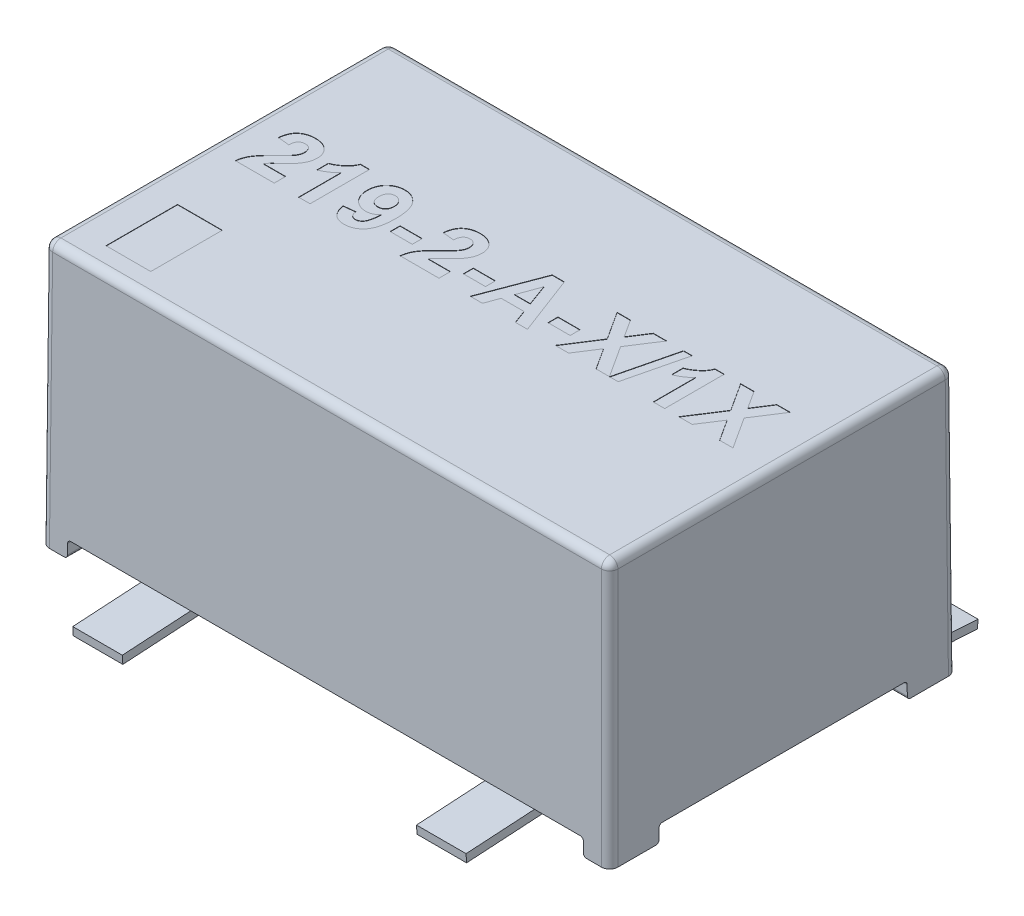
from build123d import *

# Parameters (mm, degrees)
SKETCH1_W                         = 17.2
SKETCH1_H                         = 10.5
MAIN_BODY_DEPTH                   = 7.51
STAND_OFF_FOOT_DEPTH              = 0.5
STAND_OFF_MIRROR2_COPY_1_DEPTH    = 0.5
F_0_36DEG_DRAFT_ANGLE             = -0.36
F_0_25MM_FILLET1_R                = 0.25
F_0_36_INNER_WALL_DRAFT_ANGLE     = 0.36
F_0_36_STAND_OFF_FOOT_DRAFT_ANGLE = 0.36
F_0_20MM_FILLET1_R                = 0.1
SKETCH8_W                         = 1.5
SKETCH8_H                         = 0.25
LPATTERN1_COUNT                   = 2
LPATTERN1_PITCH                   = 4.7
MIRROR2_COPY_1_SKETCH_W           = 1.5
MIRROR2_COPY_1_SKETCH_H           = 0.25
SKETCH9_W                         = 1.5
SKETCH9_H                         = 0.25
SKETCH10_W                        = 1.352618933
SKETCH10_H                        = 2.164190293
SKETCH10_W_2                      = 0.669230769
SKETCH10_H_2                      = 0.3
SKETCH10_W_3                      = 0.66923077
TEXT_2_DEPTH                      = 0.01


with BuildPart() as part:
    # Sketch1 → Main Body (new body)
    with BuildSketch(Plane(origin=(0, 0, 0), x_dir=(1, 0, 0), z_dir=(0, 1, 0))):
        Rectangle(SKETCH1_W, SKETCH1_H)
    extrude(amount=-MAIN_BODY_DEPTH)

    # Sketch2 → Stand off foot (add)
    with BuildSketch(Plane(origin=(0, -7.51, 0), x_dir=(-1, 0, 0), z_dir=(0, -1, 0))):
        Polygon((-8.6, 5.25), (-7.8, 5.25), (-7.8, 4.75), (-8.1, 4.75), (-8.1, 3.75), (-8.6, 3.75), align=None)
    stand_off_foot = extrude(amount=STAND_OFF_FOOT_DEPTH)

    # Stand off Mirror1: Stand off foot across plane
    add(stand_off_foot.mirror(Plane(origin=(0, 0, 0), x_dir=(0, 0, 1), z_dir=(1, 0, 0))))

    # Stand off Mirror2: Stand off foot across plane
    add(stand_off_foot.mirror(Plane.XY))

    # Stand off Mirror2 copy 1 sketch → Stand off Mirror2 copy 1 (add)
    with BuildSketch(Plane.XZ.offset(7.51)):
        Polygon((-8.6, 5.25), (-7.8, 5.25), (-7.8, 4.75), (-8.1, 4.75), (-8.1, 3.75), (-8.6, 3.75), align=None)
    extrude(amount=STAND_OFF_MIRROR2_COPY_1_DEPTH)

    # 0.36deg Draft
    f_0_36deg_draft_faces = [part.faces().sort_by_distance(p)[0] for p in [
        (-7.8, -7.76, -5),
        (-8.35, -7.76, -3.75),
        (8.35, -7.76, -3.75),
        (7.8, -7.76, -5),
        (8.35, -7.76, 3.75),
        (7.8, -7.76, 5),
        (-8.35, -7.76, 3.75),
        (-7.8, -7.76, 5),
        (-8.6, -3.829761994, 0),
        (0, -3.779651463, 5.25),
        (8.6, -3.829761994, 0),
        (0, -3.779651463, -5.25),
    ]]
    draft(f_0_36deg_draft_faces, Plane(origin=(0, -8.01, 0), x_dir=(0, 0, -1), z_dir=(0, -1, 0)), F_0_36DEG_DRAFT_ANGLE)

    # 0.25mm Fillet1
    f_0_25mm_fillet1_edges = [part.edges().sort_by_distance(p)[0] for p in [
        (0, 0, 5.199671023),
        (-8.549671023, 0, 0),
        (0, 0, -5.199671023),
        (8.549671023, 0, 0),
        (8.574835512, -4.005, 5.224835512),
        (-8.574835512, -4.005, 5.224835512),
        (-8.574835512, -4.005, -5.224835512),
        (8.574835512, -4.005, -5.224835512),
    ]]
    fillet(f_0_25mm_fillet1_edges, radius=F_0_25MM_FILLET1_R)

    # 0.36 Inner Wall Draft
    f_0_36_inner_wall_draft_faces = [part.faces().sort_by_distance(p)[0] for p in [
        (-8.1, -7.760131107, -4.250784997),
        (7.95078403, -7.760438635, -4.75),
        (8.1, -7.760131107, -4.250784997),
        (-7.95078403, -7.760438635, 4.75),
    ]]
    draft(f_0_36_inner_wall_draft_faces, Plane(origin=(0, -7.51, 0), x_dir=(0, 0, -1), z_dir=(0, -1, 0)), F_0_36_INNER_WALL_DRAFT_ANGLE)

    # 0.36 Stand off Foot Draft
    f_0_36_stand_off_foot_draft_faces = [part.faces().sort_by_distance(p)[0] for p in [
        (8.349215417, -7.760262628, 3.751569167),
        (8.35, -7.76, -3.751570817),
        (-8.35, -7.76, -3.751570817),
        (-8.349215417, -7.760262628, 3.751569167),
        (-7.801569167, -7.760262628, -4.999215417),
        (-7.801570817, -7.76, 5),
        (7.801570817, -7.76, -5),
        (7.801569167, -7.760262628, 4.999215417),
    ]]
    draft(f_0_36_stand_off_foot_draft_faces, Plane(origin=(0, -7.51, 0), x_dir=(0, 0, -1), z_dir=(0, -1, 0)), F_0_36_STAND_OFF_FOOT_DRAFT_ANGLE)

    # 0.20mm Fillet1
    f_0_20mm_fillet1_edges = [part.edges().sort_by_distance(p)[0] for p in [
        (8.348429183, -7.51, -3.753141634),
        (7.803141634, -7.51, -4.998429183),
        (8.351570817, -8.01, -3.756283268),
        (7.806283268, -8.01, -5.001570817),
        (-7.806283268, -8.01, -5),
        (-8.351570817, -8.01, -3.756283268),
        (-8.348429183, -7.51, -3.753141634),
        (-7.803141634, -7.51, -4.998429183),
        (-8.348429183, -7.51, 3.753141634),
        (-7.803141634, -7.51, 4.998429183),
        (-8.35, -8.01, 3.756283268),
        (-7.806283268, -8.01, 5.001570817),
        (7.806283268, -8.01, 5),
        (8.35, -8.01, 3.756283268),
        (8.348429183, -7.51, 3.753141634),
        (7.803141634, -7.51, 4.998429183),
    ]]
    fillet(f_0_20mm_fillet1_edges, radius=F_0_20MM_FILLET1_R)

    # Customer Pin 1: sweep along a curve in space
    with BuildLine() as customer_pin_1_path:
        Line((6.8, -7.51, -4.081858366), (6.8, -7.607235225, -4.081858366))
        ThreePointArc((6.8, -7.607235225, -4.081858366), (6.8, -7.864178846, -4.183719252), (6.8, -7.981535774, -4.433965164))
        Line((6.8, -7.981535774, -4.433965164), (6.8, -8.134598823, -6.936523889))
    # Sketch8 → Customer Pin 1 (sweep)
    with BuildSketch(Plane(origin=(0, -7.51, 0), x_dir=(-1, 0, 0), z_dir=(0, -1, 0))):
        with Locations((-6.8, 4.081858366)):
            Rectangle(SKETCH8_W, SKETCH8_H)
    customer_pin_1 = sweep(path=customer_pin_1_path.line)

    # LPattern1: Customer Pin 1 ×2
    with Locations(*[(-i * LPATTERN1_PITCH, 0, 0) for i in range(1, LPATTERN1_COUNT)]):
        add(customer_pin_1)

    # Mirror2: Customer Pin 1 across plane
    add(customer_pin_1.mirror(Plane.ZY))

    # Mirror2 copy 1: sweep along a curve in space
    with BuildLine() as mirror2_copy_1_path:
        Line((-2.1, -7.51, -4.081858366), (-2.1, -7.607235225, -4.081858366))
        ThreePointArc((-2.1, -7.607235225, -4.081858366), (-2.1, -7.864178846, -4.183719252), (-2.1, -7.981535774, -4.433965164))
        Line((-2.1, -7.981535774, -4.433965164), (-2.1, -8.134598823, -6.936523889))
    # Mirror2 copy 1 sketch → Mirror2 copy 1 (sweep)
    with BuildSketch(Plane(origin=(4.7, -7.51, 0), x_dir=(1, 0, 0), z_dir=(0, -1, 0))):
        with Locations((-6.8, -4.081858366)):
            Rectangle(MIRROR2_COPY_1_SKETCH_W, MIRROR2_COPY_1_SKETCH_H)
    sweep(path=mirror2_copy_1_path.line)

    # Customer Pin 2: sweep along a curve in space
    with BuildLine() as customer_pin_2_path:
        Line((5.2, -7.51, 4.081858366), (5.2, -7.607235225, 4.081858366))
        ThreePointArc((5.2, -7.607235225, 4.081858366), (5.2, -7.864178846, 4.183719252), (5.2, -7.981535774, 4.433965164))
        Line((5.2, -7.981535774, 4.433965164), (5.2, -8.134598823, 6.936523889))
    # Sketch9 → Customer Pin 2 (sweep)
    with BuildSketch(Plane.XZ.offset(7.51)):
        with Locations((5.2, 4.081858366)):
            Rectangle(SKETCH9_W, SKETCH9_H)
    customer_pin_2 = sweep(path=customer_pin_2_path.line)

    # Mirror3: Customer Pin 2 across plane
    add(customer_pin_2.mirror(Plane.ZY))

    # Sketch10 → Text 2 (cut)
    # profile 1 of 13: a face of its own
    with BuildSketch(Plane(origin=(0, 0, 0), x_dir=(1, 0, 0), z_dir=(0, 1, 0))):
        with Locations((-6.739224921, -3.389503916)):
            Rectangle(SKETCH10_W, SKETCH10_H)
    # profile 2 of 13: a face of its own
    with BuildSketch(Plane(origin=(0, 0, 0), x_dir=(1, 0, 0), z_dir=(0, 1, 0))):
        with BuildLine():
            Line((-6.512306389, 0.059716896), (-6.512306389, -0.286436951))
            Line((-6.512306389, -0.286436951), (-7.689229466, -0.286436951))
            add(Edge.make_bspline(
                [(-7.689229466, -0.286436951), (-7.685244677, -0.256853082), (-7.677277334, -0.197701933), (-7.652645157, -0.111296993), (-7.619769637, -0.026980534), (-7.584089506, 0.041632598), (-7.548601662, 0.096863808), (-7.51640354, 0.142120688), (-7.477992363, 0.190272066), (-7.433925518, 0.241706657), (-7.384446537, 0.296585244), (-7.329186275, 0.354703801), (-7.267881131, 0.415784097), (-7.224751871, 0.457260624), (-7.20245062, 0.47870728)],
                knots=[0, 0, 0, 0, 1.156289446, 2.311930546, 3.473459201, 4.661751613, 5.303057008, 6.018253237, 6.81459331, 7.690699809, 8.644447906, 9.679642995, 10.800191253, 12, 12, 12, 12], degree=3))
            add(Edge.make_bspline(
                [(-7.20245062, 0.47870728), (-7.184653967, 0.495885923), (-7.15077438, 0.528588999), (-7.102529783, 0.575418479), (-7.060117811, 0.618468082), (-7.022651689, 0.656622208), (-6.990996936, 0.690852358), (-6.964737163, 0.720620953), (-6.943539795, 0.746049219), (-6.932059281, 0.762180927), (-6.926969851, 0.76933228)],
                knots=[0, 0, 0, 0, 1.480720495, 2.818855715, 4.024636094, 5.098235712, 6.019786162, 6.815086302, 7.474715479, 8, 8, 8, 8], degree=3))
            add(Edge.make_bspline(
                [(-6.926969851, 0.76933228), (-6.916547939, 0.786644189), (-6.896445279, 0.820036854), (-6.874401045, 0.872547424), (-6.861169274, 0.925047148), (-6.859353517, 0.960127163), (-6.858460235, 0.977385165)],
                knots=[0, 0, 0, 0, 1.0911822, 2.104764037, 3.067617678, 4, 4, 4, 4], degree=3))
            add(Edge.make_bspline(
                [(-6.858460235, 0.977385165), (-6.859108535, 0.995344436), (-6.860335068, 1.029321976), (-6.870619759, 1.077270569), (-6.888857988, 1.118489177), (-6.913968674, 1.153104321), (-6.945721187, 1.180225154), (-6.982840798, 1.200264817), (-7.025870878, 1.211344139), (-7.056114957, 1.212801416), (-7.071921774, 1.213563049)],
                knots=[0, 0, 0, 0, 1.193122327, 2.257294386, 3.237245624, 4.168877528, 5.075331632, 5.990371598, 6.949684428, 8, 8, 8, 8], degree=3))
            add(Edge.make_bspline(
                [(-7.071921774, 1.213563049), (-7.087621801, 1.212851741), (-7.117950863, 1.211477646), (-7.161055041, 1.19947374), (-7.198763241, 1.178693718), (-7.22563611, 1.155012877), (-7.243790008, 1.13198498), (-7.256159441, 1.111917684), (-7.266820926, 1.089115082), (-7.276267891, 1.063833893), (-7.283729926, 1.035784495), (-7.289739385, 1.005180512), (-7.29458214, 0.97185725), (-7.296122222, 0.948675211), (-7.296921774, 0.936639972)],
                knots=[0, 0, 0, 0, 1.402788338, 2.709884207, 3.961032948, 5.225417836, 5.883680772, 6.578928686, 7.329201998, 8.132101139, 8.990263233, 9.922304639, 10.921339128, 12, 12, 12, 12], degree=3))
            Line((-7.296921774, 0.936639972), (-7.64307562, 0.970534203))
            add(Edge.make_bspline(
                [(-7.64307562, 0.970534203), (-7.640292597, 0.993903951), (-7.634896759, 1.039214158), (-7.621431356, 1.104295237), (-7.604377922, 1.164335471), (-7.582923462, 1.219223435), (-7.557954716, 1.269308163), (-7.528198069, 1.313838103), (-7.49469325, 1.353306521), (-7.457411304, 1.387692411), (-7.416589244, 1.417105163), (-7.373753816, 1.443360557), (-7.328067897, 1.464898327), (-7.280034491, 1.482648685), (-7.229675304, 1.496834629), (-7.176757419, 1.506214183), (-7.121607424, 1.512811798), (-7.083961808, 1.513308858), (-7.064710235, 1.513563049)],
                knots=[0, 0, 0, 0, 1.270971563, 2.464210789, 3.586263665, 4.638946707, 5.643716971, 6.603612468, 7.52484387, 8.434700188, 9.336036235, 10.239171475, 11.145359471, 12.059630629, 13.003312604, 13.96741569, 14.960557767, 16, 16, 16, 16], degree=3))
            add(Edge.make_bspline(
                [(-7.064710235, 1.513563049), (-7.043781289, 1.513160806), (-7.003019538, 1.512377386), (-6.943514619, 1.5059079), (-6.887614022, 1.494627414), (-6.834829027, 1.479684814), (-6.785701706, 1.45973535), (-6.739822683, 1.435617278), (-6.697914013, 1.406415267), (-6.659350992, 1.373721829), (-6.624878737, 1.337769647), (-6.594684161, 1.299420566), (-6.569387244, 1.258701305), (-6.548159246, 1.216108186), (-6.532397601, 1.170955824), (-6.520912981, 1.123868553), (-6.513298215, 1.0746267), (-6.512640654, 1.040995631), (-6.512306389, 1.023899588)],
                knots=[0, 0, 0, 0, 1.210756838, 2.35810096, 3.457354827, 4.507168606, 5.527358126, 6.519769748, 7.499700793, 8.476517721, 9.440526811, 10.376769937, 11.295256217, 12.209626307, 13.124630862, 14.055668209, 15.011616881, 16, 16, 16, 16], degree=3))
            add(Edge.make_bspline(
                [(-6.512306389, 1.023899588), (-6.512746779, 1.004278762), (-6.513620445, 0.965354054), (-6.521985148, 0.907811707), (-6.534764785, 0.851596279), (-6.553652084, 0.796570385), (-6.5775932, 0.741414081), (-6.608453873, 0.686003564), (-6.644285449, 0.628667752), (-6.672340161, 0.591597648), (-6.68682562, 0.57245728)],
                knots=[0, 0, 0, 0, 0.953409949, 1.89141903, 2.821310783, 3.752688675, 4.715703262, 5.740811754, 6.833515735, 8, 8, 8, 8], degree=3))
            add(Edge.make_bspline(
                [(-6.68682562, 0.57245728), (-6.692300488, 0.565561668), (-6.704026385, 0.550792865), (-6.723975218, 0.52814719), (-6.7470942, 0.503410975), (-6.773056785, 0.476121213), (-6.802720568, 0.447244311), (-6.835018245, 0.415572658), (-6.871371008, 0.382726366), (-6.90902366, 0.347886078), (-6.946839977, 0.313976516), (-6.981598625, 0.281769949), (-7.013171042, 0.253274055), (-7.040086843, 0.226915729), (-7.063929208, 0.204493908), (-7.08383878, 0.184858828), (-7.100188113, 0.168485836), (-7.122716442, 0.142964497), (-7.151381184, 0.108446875), (-7.171548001, 0.075464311), (-7.181176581, 0.059716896)],
                knots=[0, 0, 0, 0, 0.665555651, 1.425465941, 2.280616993, 3.225313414, 4.272635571, 5.410053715, 6.644756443, 7.976022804, 9.288331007, 10.484517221, 11.558462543, 12.503158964, 13.33222979, 14.032602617, 14.617328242, 15.080653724, 16.606167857, 18, 18, 18, 18], degree=3))
            Line((-7.181176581, 0.059716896), (-6.512306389, 0.059716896))
        make_face()
    # profile 3 of 13: a face of its own
    with BuildSketch(Plane(origin=(0, 0, 0), x_dir=(1, 0, 0), z_dir=(0, 1, 0))):
        with BuildLine():
            Line((-5.427691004, -0.286436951), (-5.773844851, -0.286436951))
            Line((-5.773844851, -0.286436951), (-5.773844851, 0.995053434))
            add(Edge.make_bspline(
                [(-5.773844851, 0.995053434), (-5.789534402, 0.979125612), (-5.820700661, 0.947486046), (-5.870478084, 0.903353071), (-5.922154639, 0.862297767), (-5.976241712, 0.824710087), (-6.032032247, 0.79005447), (-6.090096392, 0.758604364), (-6.150013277, 0.729924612), (-6.191520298, 0.713897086), (-6.212306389, 0.705870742)],
                knots=[0, 0, 0, 0, 1.012567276, 2.011397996, 3.011400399, 4.000747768, 4.993445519, 5.985067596, 6.990952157, 8, 8, 8, 8], degree=3))
            Line((-6.212306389, 0.705870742), (-6.212306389, 1.052024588))
            add(Edge.make_bspline(
                [(-6.212306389, 1.052024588), (-6.189253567, 1.060668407), (-6.141005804, 1.078759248), (-6.069808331, 1.117239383), (-5.995494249, 1.164881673), (-5.933066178, 1.211607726), (-5.883500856, 1.253150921), (-5.848858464, 1.286545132), (-5.816760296, 1.320742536), (-5.788412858, 1.3568469), (-5.763072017, 1.394128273), (-5.740618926, 1.432525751), (-5.720855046, 1.472160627), (-5.710508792, 1.499761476), (-5.705335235, 1.513563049)],
                knots=[0, 0, 0, 0, 1.253673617, 2.623841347, 4.114270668, 5.751233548, 6.594491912, 7.409089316, 8.202422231, 8.983165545, 9.746111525, 10.498431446, 11.249153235, 12, 12, 12, 12], degree=3))
            Line((-5.705335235, 1.513563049), (-5.427691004, 1.513563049))
            Line((-5.427691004, 1.513563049), (-5.427691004, -0.286436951))
        make_face()
    # profile 4 of 13: a face of its own
    with BuildSketch(Plane(origin=(0, 0, 0), x_dir=(1, 0, 0), z_dir=(0, 1, 0))):
        with BuildLine():
            Line((-4.873844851, 0.15995728), (-4.527691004, 0.198178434))
            add(Edge.make_bspline(
                [(-4.527691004, 0.198178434), (-4.52542437, 0.181605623), (-4.521139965, 0.150279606), (-4.507440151, 0.107293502), (-4.490269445, 0.070394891), (-4.466935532, 0.040701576), (-4.439089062, 0.01803725), (-4.407196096, 0.001682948), (-4.371129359, -0.007737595), (-4.345775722, -0.00890702), (-4.332618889, -0.009513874)],
                knots=[0, 0, 0, 0, 1.261142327, 2.383817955, 3.394783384, 4.319218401, 5.209639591, 6.086630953, 7.00709008, 8, 8, 8, 8], degree=3))
            add(Edge.make_bspline(
                [(-4.332618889, -0.009513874), (-4.324054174, -0.009315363), (-4.307127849, -0.008923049), (-4.282366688, -0.003392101), (-4.258405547, 0.004361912), (-4.235491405, 0.015710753), (-4.213843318, 0.030316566), (-4.192924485, 0.047849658), (-4.17337656, 0.068872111), (-4.153959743, 0.093002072), (-4.136384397, 0.12264467), (-4.120873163, 0.158598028), (-4.106390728, 0.200852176), (-4.094494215, 0.249932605), (-4.083786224, 0.305416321), (-4.074470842, 0.367480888), (-4.066913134, 0.436164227), (-4.063572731, 0.484221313), (-4.06182562, 0.509356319)],
                knots=[0, 0, 0, 0, 0.636702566, 1.258306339, 1.881198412, 2.509855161, 3.155497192, 3.822694, 4.538353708, 5.290656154, 6.125969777, 7.095962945, 8.203044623, 9.449504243, 10.854253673, 12.411741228, 14.12325476, 16, 16, 16, 16], degree=3))
            add(Edge.make_bspline(
                [(-4.06182562, 0.509356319), (-4.072899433, 0.49747065), (-4.094733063, 0.474036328), (-4.130894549, 0.443291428), (-4.16939721, 0.417443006), (-4.21004407, 0.396608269), (-4.252411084, 0.379586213), (-4.297194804, 0.368389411), (-4.343771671, 0.360707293), (-4.375615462, 0.360050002), (-4.391753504, 0.359716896)],
                knots=[0, 0, 0, 0, 1.041520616, 2.053509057, 3.037255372, 4.009786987, 4.979165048, 5.959157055, 6.965725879, 8, 8, 8, 8], degree=3))
            add(Edge.make_bspline(
                [(-4.391753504, 0.359716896), (-4.409444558, 0.360224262), (-4.444374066, 0.361226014), (-4.495760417, 0.368501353), (-4.545271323, 0.380907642), (-4.592985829, 0.398111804), (-4.638662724, 0.420915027), (-4.682884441, 0.447799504), (-4.724702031, 0.48034149), (-4.764725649, 0.516703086), (-4.800718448, 0.557638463), (-4.832863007, 0.601532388), (-4.860063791, 0.64862628), (-4.882003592, 0.698870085), (-4.898971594, 0.751943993), (-4.911307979, 0.807803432), (-4.918516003, 0.866739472), (-4.919497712, 0.90705288), (-4.919998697, 0.927625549)],
                knots=[0, 0, 0, 0, 0.980269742, 1.935460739, 2.869230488, 3.804804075, 4.740187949, 5.694100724, 6.667990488, 7.67211685, 8.68661751, 9.683203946, 10.682901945, 11.694007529, 12.71565541, 13.766145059, 14.860022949, 16, 16, 16, 16], degree=3))
            add(Edge.make_bspline(
                [(-4.919998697, 0.927625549), (-4.919542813, 0.94904508), (-4.918648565, 0.991061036), (-4.910803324, 1.052316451), (-4.898821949, 1.110626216), (-4.880931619, 1.165473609), (-4.858669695, 1.217447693), (-4.830999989, 1.265896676), (-4.798839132, 1.311494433), (-4.761257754, 1.352885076), (-4.720406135, 1.390774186), (-4.676337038, 1.423746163), (-4.629306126, 1.451301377), (-4.579730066, 1.474200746), (-4.527236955, 1.491836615), (-4.472162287, 1.504404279), (-4.414452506, 1.51219689), (-4.375071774, 1.513101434), (-4.354974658, 1.513563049)],
                knots=[0, 0, 0, 0, 1.1238417, 2.204496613, 3.236450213, 4.243990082, 5.227299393, 6.199188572, 7.167261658, 8.150145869, 9.127934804, 10.088143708, 11.032722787, 11.984040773, 12.949643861, 13.93368149, 14.945498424, 16, 16, 16, 16], degree=3))
            add(Edge.make_bspline(
                [(-4.354974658, 1.513563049), (-4.333064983, 1.512957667), (-4.290102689, 1.511770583), (-4.227136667, 1.501885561), (-4.167391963, 1.485067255), (-4.11027493, 1.462514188), (-4.05660884, 1.432467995), (-4.005695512, 1.396204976), (-3.958215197, 1.352984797), (-3.913336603, 1.303663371), (-3.872504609, 1.246672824), (-3.837740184, 1.180806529), (-3.80816922, 1.106688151), (-3.784300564, 1.024158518), (-3.765650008, 0.93323879), (-3.752777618, 0.833930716), (-3.744164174, 0.726214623), (-3.743447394, 0.651562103), (-3.74307562, 0.612841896)],
                knots=[0, 0, 0, 0, 0.854852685, 1.67626545, 2.479841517, 3.273455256, 4.067207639, 4.874322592, 5.708061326, 6.568303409, 7.473035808, 8.43640186, 9.467839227, 10.582672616, 11.785182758, 13.086903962, 14.489057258, 16, 16, 16, 16], degree=3))
            add(Edge.make_bspline(
                [(-3.74307562, 0.612841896), (-3.743612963, 0.573522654), (-3.744651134, 0.497556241), (-3.75302774, 0.387888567), (-3.766286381, 0.286627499), (-3.785780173, 0.193953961), (-3.81024355, 0.109534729), (-3.841004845, 0.033691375), (-3.876831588, -0.033967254), (-3.918771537, -0.092818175), (-3.964878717, -0.143966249), (-4.014435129, -0.188277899), (-4.067511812, -0.225619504), (-4.123648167, -0.256767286), (-4.183683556, -0.280092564), (-4.246787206, -0.296991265), (-4.31312887, -0.307938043), (-4.358536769, -0.30898221), (-4.381657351, -0.309513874)],
                knots=[0, 0, 0, 0, 1.487495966, 2.873904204, 4.158892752, 5.348685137, 6.453750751, 7.479786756, 8.440129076, 9.343583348, 10.206541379, 11.040779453, 11.853317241, 12.65721927, 13.463689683, 14.283322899, 15.125910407, 16, 16, 16, 16], degree=3))
            add(Edge.make_bspline(
                [(-4.381657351, -0.309513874), (-4.398257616, -0.309172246), (-4.430828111, -0.308501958), (-4.478513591, -0.303109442), (-4.523761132, -0.293738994), (-4.566420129, -0.280652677), (-4.606823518, -0.264560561), (-4.644628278, -0.244145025), (-4.679844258, -0.219872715), (-4.713071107, -0.192489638), (-4.742974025, -0.160748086), (-4.77048115, -0.125703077), (-4.795156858, -0.087003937), (-4.816172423, -0.044318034), (-4.835571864, 0.001364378), (-4.851198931, 0.051055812), (-4.864232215, 0.104195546), (-4.870584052, 0.14104178), (-4.873844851, 0.15995728)],
                knots=[0, 0, 0, 0, 1.056675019, 2.073245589, 3.050223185, 3.994251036, 4.910773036, 5.814621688, 6.723026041, 7.630269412, 8.550362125, 9.493303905, 10.463425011, 11.466105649, 12.519144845, 13.620215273, 14.778306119, 16, 16, 16, 16], degree=3))
        make_face()
        with BuildLine():
            add(Edge.make_bspline(
                [(-4.089229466, 0.918971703), (-4.089356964, 0.930404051), (-4.089604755, 0.952622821), (-4.093818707, 0.984799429), (-4.099932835, 1.014930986), (-4.108030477, 1.043351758), (-4.119336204, 1.069591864), (-4.132745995, 1.094064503), (-4.14859124, 1.116573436), (-4.172984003, 1.142868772), (-4.206095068, 1.171173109), (-4.250450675, 1.195758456), (-4.298091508, 1.211087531), (-4.331063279, 1.212730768), (-4.34776312, 1.213563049)],
                knots=[0, 0, 0, 0, 0.937516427, 1.822063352, 2.657744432, 3.45986214, 4.242145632, 4.997087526, 5.746986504, 6.494090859, 7.936347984, 9.300605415, 10.632786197, 12, 12, 12, 12], degree=3))
            add(Edge.make_bspline(
                [(-4.34776312, 1.213563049), (-4.363351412, 1.212856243), (-4.393692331, 1.211480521), (-4.437116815, 1.199116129), (-4.476454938, 1.179048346), (-4.505108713, 1.155636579), (-4.52552873, 1.133306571), (-4.538327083, 1.113303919), (-4.549224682, 1.09100809), (-4.558247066, 1.06622899), (-4.5653663, 1.03895319), (-4.570413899, 1.009035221), (-4.573161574, 0.97671601), (-4.573612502, 0.954313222), (-4.573844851, 0.94276978)],
                knots=[0, 0, 0, 0, 1.397188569, 2.719475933, 4.017809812, 5.337496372, 6.01771949, 6.727108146, 7.460709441, 8.242571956, 9.09066939, 9.98839818, 10.963485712, 12, 12, 12, 12], degree=3))
            add(Edge.make_bspline(
                [(-4.573844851, 0.94276978), (-4.573658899, 0.93098146), (-4.573299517, 0.908198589), (-4.569928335, 0.875192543), (-4.564870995, 0.844567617), (-4.556655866, 0.816562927), (-4.547003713, 0.79077981), (-4.535348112, 0.767139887), (-4.520546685, 0.746516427), (-4.499165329, 0.72205473), (-4.467883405, 0.69715436), (-4.425468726, 0.675442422), (-4.378612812, 0.662019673), (-4.345809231, 0.660496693), (-4.32901312, 0.659716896)],
                knots=[0, 0, 0, 0, 1.000122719, 1.932902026, 2.813346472, 3.630219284, 4.405058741, 5.14865055, 5.858963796, 6.55275156, 7.902081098, 9.220520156, 10.576848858, 12, 12, 12, 12], degree=3))
            add(Edge.make_bspline(
                [(-4.32901312, 0.659716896), (-4.312690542, 0.660356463), (-4.28084105, 0.661604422), (-4.235527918, 0.674933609), (-4.193930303, 0.69537909), (-4.163496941, 0.719509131), (-4.141740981, 0.742363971), (-4.127738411, 0.761991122), (-4.115667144, 0.783472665), (-4.106027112, 0.806999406), (-4.098445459, 0.832367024), (-4.093106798, 0.85953407), (-4.089791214, 0.888600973), (-4.089420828, 0.908625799), (-4.089229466, 0.918971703)],
                knots=[0, 0, 0, 0, 1.470045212, 2.868431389, 4.227473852, 5.634383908, 6.348475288, 7.071419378, 7.805118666, 8.569021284, 9.362200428, 10.192314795, 11.06605236, 12, 12, 12, 12], degree=3))
        make_face(mode=Mode.SUBTRACT)
    # profile 5 of 13: a face of its own
    with BuildSketch(Plane(origin=(0, 0, 0), x_dir=(1, 0, 0), z_dir=(0, 1, 0))):
        with Locations((-3.154614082, 0.348178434)):
            Rectangle(SKETCH10_W_2, SKETCH10_H_2)
    # profile 6 of 13: a face of its own
    with BuildSketch(Plane(origin=(0, 0, 0), x_dir=(1, 0, 0), z_dir=(0, 1, 0))):
        with BuildLine():
            Line((-1.527691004, 0.059716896), (-1.527691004, -0.286436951))
            Line((-1.527691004, -0.286436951), (-2.704614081, -0.286436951))
            add(Edge.make_bspline(
                [(-2.704614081, -0.286436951), (-2.700629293, -0.256853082), (-2.692661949, -0.197701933), (-2.668029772, -0.111296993), (-2.635154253, -0.026980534), (-2.599474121, 0.041632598), (-2.563986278, 0.096863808), (-2.531788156, 0.142120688), (-2.493376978, 0.190272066), (-2.449310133, 0.241706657), (-2.399831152, 0.296585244), (-2.34457089, 0.354703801), (-2.283265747, 0.415784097), (-2.240136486, 0.457260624), (-2.217835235, 0.47870728)],
                knots=[0, 0, 0, 0, 1.156289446, 2.311930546, 3.473459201, 4.661751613, 5.303057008, 6.018253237, 6.81459331, 7.690699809, 8.644447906, 9.679642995, 10.800191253, 12, 12, 12, 12], degree=3))
            add(Edge.make_bspline(
                [(-2.217835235, 0.47870728), (-2.200038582, 0.495885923), (-2.166158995, 0.528588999), (-2.117914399, 0.575418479), (-2.075502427, 0.618468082), (-2.038036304, 0.656622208), (-2.006381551, 0.690852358), (-1.980121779, 0.720620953), (-1.95892441, 0.746049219), (-1.947443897, 0.762180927), (-1.942354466, 0.76933228)],
                knots=[0, 0, 0, 0, 1.480720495, 2.818855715, 4.024636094, 5.098235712, 6.019786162, 6.815086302, 7.474715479, 8, 8, 8, 8], degree=3))
            add(Edge.make_bspline(
                [(-1.942354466, 0.76933228), (-1.931932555, 0.786644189), (-1.911829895, 0.820036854), (-1.88978566, 0.872547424), (-1.876553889, 0.925047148), (-1.874738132, 0.960127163), (-1.873844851, 0.977385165)],
                knots=[0, 0, 0, 0, 1.0911822, 2.104764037, 3.067617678, 4, 4, 4, 4], degree=3))
            add(Edge.make_bspline(
                [(-1.873844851, 0.977385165), (-1.874493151, 0.995344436), (-1.875719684, 1.029321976), (-1.886004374, 1.077270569), (-1.904242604, 1.118489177), (-1.92935329, 1.153104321), (-1.961105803, 1.180225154), (-1.998225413, 1.200264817), (-2.041255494, 1.211344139), (-2.071499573, 1.212801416), (-2.087306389, 1.213563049)],
                knots=[0, 0, 0, 0, 1.193122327, 2.257294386, 3.237245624, 4.168877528, 5.075331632, 5.990371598, 6.949684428, 8, 8, 8, 8], degree=3))
            add(Edge.make_bspline(
                [(-2.087306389, 1.213563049), (-2.103006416, 1.212851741), (-2.133335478, 1.211477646), (-2.176439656, 1.19947374), (-2.214147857, 1.178693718), (-2.241020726, 1.155012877), (-2.259174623, 1.13198498), (-2.271544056, 1.111917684), (-2.282205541, 1.089115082), (-2.291652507, 1.063833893), (-2.299114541, 1.035784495), (-2.305124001, 1.005180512), (-2.309966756, 0.97185725), (-2.311506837, 0.948675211), (-2.312306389, 0.936639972)],
                knots=[0, 0, 0, 0, 1.402788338, 2.709884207, 3.961032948, 5.225417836, 5.883680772, 6.578928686, 7.329201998, 8.132101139, 8.990263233, 9.922304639, 10.921339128, 12, 12, 12, 12], degree=3))
            Line((-2.312306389, 0.936639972), (-2.658460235, 0.970534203))
            add(Edge.make_bspline(
                [(-2.658460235, 0.970534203), (-2.655677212, 0.993903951), (-2.650281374, 1.039214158), (-2.636815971, 1.104295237), (-2.619762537, 1.164335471), (-2.598308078, 1.219223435), (-2.573339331, 1.269308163), (-2.543582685, 1.313838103), (-2.510077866, 1.353306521), (-2.472795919, 1.387692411), (-2.431973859, 1.417105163), (-2.389138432, 1.443360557), (-2.343452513, 1.464898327), (-2.295419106, 1.482648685), (-2.245059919, 1.496834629), (-2.192142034, 1.506214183), (-2.136992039, 1.512811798), (-2.099346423, 1.513308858), (-2.080094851, 1.513563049)],
                knots=[0, 0, 0, 0, 1.270971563, 2.464210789, 3.586263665, 4.638946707, 5.643716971, 6.603612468, 7.52484387, 8.434700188, 9.336036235, 10.239171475, 11.145359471, 12.059630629, 13.003312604, 13.96741569, 14.960557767, 16, 16, 16, 16], degree=3))
            add(Edge.make_bspline(
                [(-2.080094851, 1.513563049), (-2.059165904, 1.513160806), (-2.018404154, 1.512377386), (-1.958899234, 1.5059079), (-1.902998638, 1.494627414), (-1.850213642, 1.479684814), (-1.801086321, 1.45973535), (-1.755207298, 1.435617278), (-1.713298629, 1.406415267), (-1.674735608, 1.373721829), (-1.640263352, 1.337769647), (-1.610068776, 1.299420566), (-1.584771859, 1.258701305), (-1.563543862, 1.216108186), (-1.547782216, 1.170955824), (-1.536297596, 1.123868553), (-1.528682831, 1.0746267), (-1.52802527, 1.040995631), (-1.527691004, 1.023899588)],
                knots=[0, 0, 0, 0, 1.210756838, 2.35810096, 3.457354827, 4.507168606, 5.527358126, 6.519769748, 7.499700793, 8.476517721, 9.440526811, 10.376769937, 11.295256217, 12.209626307, 13.124630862, 14.055668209, 15.011616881, 16, 16, 16, 16], degree=3))
            add(Edge.make_bspline(
                [(-1.527691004, 1.023899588), (-1.528131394, 1.004278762), (-1.52900506, 0.965354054), (-1.537369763, 0.907811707), (-1.550149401, 0.851596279), (-1.569036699, 0.796570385), (-1.592977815, 0.741414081), (-1.623838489, 0.686003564), (-1.659670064, 0.628667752), (-1.687724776, 0.591597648), (-1.702210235, 0.57245728)],
                knots=[0, 0, 0, 0, 0.953409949, 1.89141903, 2.821310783, 3.752688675, 4.715703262, 5.740811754, 6.833515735, 8, 8, 8, 8], degree=3))
            add(Edge.make_bspline(
                [(-1.702210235, 0.57245728), (-1.707685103, 0.565561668), (-1.719411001, 0.550792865), (-1.739359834, 0.52814719), (-1.762478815, 0.503410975), (-1.7884414, 0.476121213), (-1.818105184, 0.447244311), (-1.850402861, 0.415572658), (-1.886755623, 0.382726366), (-1.924408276, 0.347886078), (-1.962224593, 0.313976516), (-1.99698324, 0.281769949), (-2.028555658, 0.253274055), (-2.055471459, 0.226915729), (-2.079313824, 0.204493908), (-2.099223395, 0.184858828), (-2.115572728, 0.168485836), (-2.138101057, 0.142964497), (-2.166765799, 0.108446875), (-2.186932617, 0.075464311), (-2.196561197, 0.059716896)],
                knots=[0, 0, 0, 0, 0.665555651, 1.425465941, 2.280616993, 3.225313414, 4.272635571, 5.410053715, 6.644756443, 7.976022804, 9.288331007, 10.484517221, 11.558462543, 12.503158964, 13.33222979, 14.032602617, 14.617328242, 15.080653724, 16.606167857, 18, 18, 18, 18], degree=3))
            Line((-2.196561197, 0.059716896), (-1.527691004, 0.059716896))
        make_face()
    # profile 7 of 13: a face of its own
    with BuildSketch(Plane(origin=(0, 0, 0), x_dir=(1, 0, 0), z_dir=(0, 1, 0))):
        with Locations((-0.939229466, 0.348178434)):
            Rectangle(SKETCH10_W_3, SKETCH10_H_2)
    # profile 8 of 13: a face of its own
    with BuildSketch(Plane(origin=(0, 0, 0), x_dir=(1, 0, 0), z_dir=(0, 1, 0))):
        Polygon((1.149232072, -0.286436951), (0.782164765, -0.286436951), (0.63036188, 0.128947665), (-0.060503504, 0.128947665), (-0.212306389, -0.286436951), (-0.581537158, -0.286436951), (0.098871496, 1.513563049), (0.465578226, 1.513563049), align=None)
        Polygon((0.520385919, 0.428947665), (0.283847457, 1.075101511), (0.048030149, 0.428947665), align=None, mode=Mode.SUBTRACT)
    # profile 9 of 13: a face of its own
    with BuildSketch(Plane(origin=(0, 0, 0), x_dir=(1, 0, 0), z_dir=(0, 1, 0))):
        with Locations((1.622308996, 0.348178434)):
            Rectangle(SKETCH10_W_2, SKETCH10_H_2)
    # profile 10 of 13: a face of its own
    with BuildSketch(Plane(origin=(0, 0, 0), x_dir=(1, 0, 0), z_dir=(0, 1, 0))):
        Polygon((1.991539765, -0.286436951), (2.60848688, 0.666928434), (2.060770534, 1.513563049), (2.465337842, 1.513563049), (2.810770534, 0.979548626), (3.156203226, 1.513563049), (3.560770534, 1.513563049), (3.013054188, 0.666928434), (3.630001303, -0.286436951), (3.225433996, -0.286436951), (2.810770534, 0.354308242), (2.396107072, -0.286436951), align=None)
    # profile 11 of 13: a face of its own
    with BuildSketch(Plane(origin=(0, 0, 0), x_dir=(1, 0, 0), z_dir=(0, 1, 0))):
        Polygon((3.634328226, -0.286436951), (4.073150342, 1.513563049), (4.333847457, 1.513563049), (3.895385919, -0.286436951), align=None)
    # profile 12 of 13: a face of its own
    with BuildSketch(Plane(origin=(0, 0, 0), x_dir=(1, 0, 0), z_dir=(0, 1, 0))):
        with BuildLine():
            Line((5.303078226, -0.286436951), (4.95692438, -0.286436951))
            Line((4.95692438, -0.286436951), (4.95692438, 0.995053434))
            add(Edge.make_bspline(
                [(4.95692438, 0.995053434), (4.941234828, 0.979125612), (4.91006857, 0.947486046), (4.860291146, 0.903353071), (4.808614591, 0.862297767), (4.754527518, 0.824710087), (4.698736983, 0.79005447), (4.640672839, 0.758604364), (4.580755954, 0.729924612), (4.539248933, 0.713897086), (4.518462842, 0.705870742)],
                knots=[0, 0, 0, 0, 1.012567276, 2.011397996, 3.011400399, 4.000747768, 4.993445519, 5.985067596, 6.990952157, 8, 8, 8, 8], degree=3))
            Line((4.518462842, 0.705870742), (4.518462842, 1.052024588))
            add(Edge.make_bspline(
                [(4.518462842, 1.052024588), (4.541515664, 1.060668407), (4.589763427, 1.078759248), (4.6609609, 1.117239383), (4.735274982, 1.164881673), (4.797703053, 1.211607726), (4.847268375, 1.253150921), (4.881910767, 1.286545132), (4.914008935, 1.320742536), (4.942356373, 1.3568469), (4.967697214, 1.394128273), (4.990150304, 1.432525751), (5.009914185, 1.472160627), (5.020260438, 1.499761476), (5.025433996, 1.513563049)],
                knots=[0, 0, 0, 0, 1.253673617, 2.623841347, 4.114270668, 5.751233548, 6.594491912, 7.409089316, 8.202422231, 8.983165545, 9.746111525, 10.498431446, 11.249153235, 12, 12, 12, 12], degree=3))
            Line((5.025433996, 1.513563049), (5.303078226, 1.513563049))
            Line((5.303078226, 1.513563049), (5.303078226, -0.286436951))
        make_face()
    # profile 13 of 13: a face of its own
    with BuildSketch(Plane(origin=(0, 0, 0), x_dir=(1, 0, 0), z_dir=(0, 1, 0))):
        Polygon((5.730001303, -0.286436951), (6.346948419, 0.666928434), (5.799232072, 1.513563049), (6.20379938, 1.513563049), (6.549232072, 0.979548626), (6.894664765, 1.513563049), (7.299232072, 1.513563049), (6.751515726, 0.666928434), (7.368462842, -0.286436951), (6.963895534, -0.286436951), (6.549232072, 0.354308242), (6.134568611, -0.286436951), align=None)
    extrude(amount=-TEXT_2_DEPTH, mode=Mode.SUBTRACT)


solid = part.part
